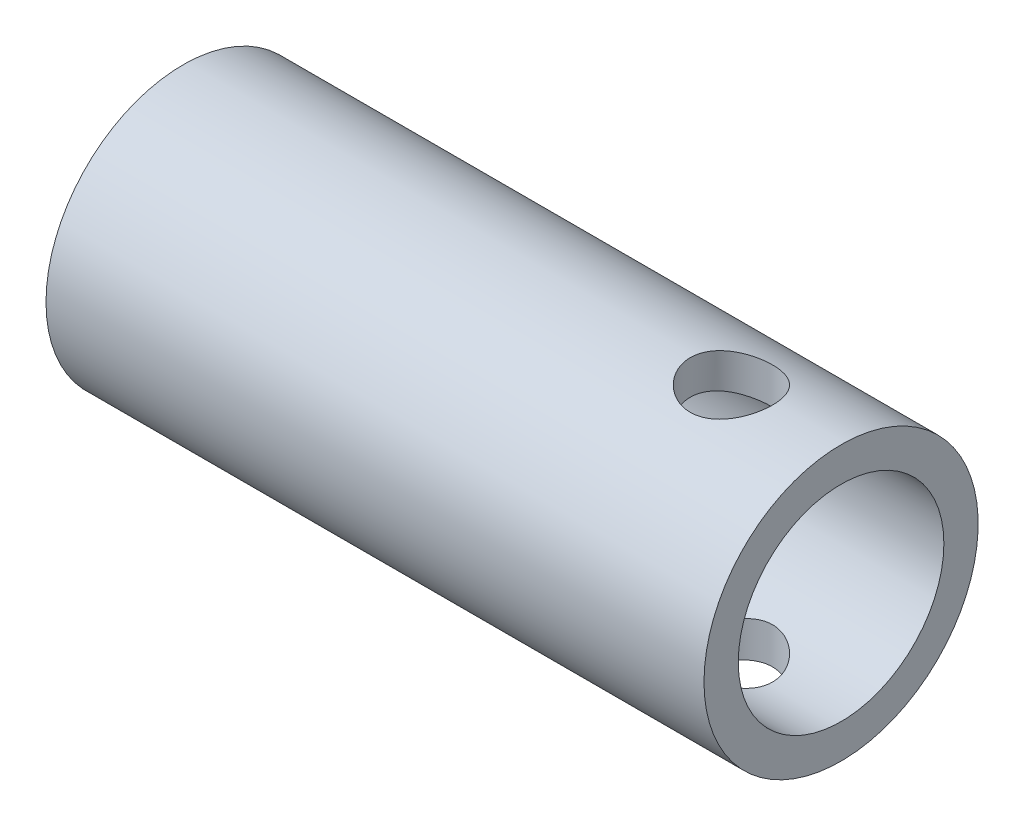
from build123d import *

# Parameters (mm, degrees)
SKETCH4_W          = 152.4
SKETCH4_H          = 63.5
EXTRUDE2_DEPTH     = 63.5
SKETCH5_R          = 9.525
CUT_EXTRUDE2_DEPTH = 63.5
SKETCH6_OUTSIDE_W  = 100.878
SKETCH6_OUTSIDE_H  = 100.878
SKETCH6_OUTSIDE_R  = 31.75
CUT_EXTRUDE3_DEPTH = 152.4
SKETCH7_R          = 23.8125
CUT_EXTRUDE4_DEPTH = 152.4


with BuildPart() as part:
    # Sketch4 → Extrude2 (new body)
    with BuildSketch(Plane(origin=(0, 0, 0), x_dir=(1, 0, 0), z_dir=(0, 1, 0))):
        with Locations((-76.2, -31.75)):
            Rectangle(SKETCH4_W, SKETCH4_H)
    extrude(amount=EXTRUDE2_DEPTH)

    # Sketch5 → Cut-Extrude2 (cut)
    with BuildSketch(Plane(origin=(0, 63.5, 0), x_dir=(1, 0, 0), z_dir=(0, 1, 0))):
        with Locations(Location((-25.4, -31.75, 0), (0, 0, 270))):
            Circle(SKETCH5_R)
    extrude(amount=-CUT_EXTRUDE2_DEPTH, mode=Mode.SUBTRACT)

    # Sketch6 outside → Cut-Extrude3 (cut)
    with BuildSketch(Plane.ZY.offset(152.4)):
        with Locations((31.75, 31.75)):
            Rectangle(SKETCH6_OUTSIDE_W, SKETCH6_OUTSIDE_H)
        with Locations((31.75, 31.75)):
            Circle(SKETCH6_OUTSIDE_R, mode=Mode.SUBTRACT)
    extrude(amount=-CUT_EXTRUDE3_DEPTH, mode=Mode.SUBTRACT)

    # Sketch7 → Cut-Extrude4 (cut)
    with BuildSketch(Plane.ZY.offset(152.4)):
        with Locations((31.75, 31.75)):
            Circle(SKETCH7_R)
    extrude(amount=-CUT_EXTRUDE4_DEPTH, mode=Mode.SUBTRACT)


solid = part.part
